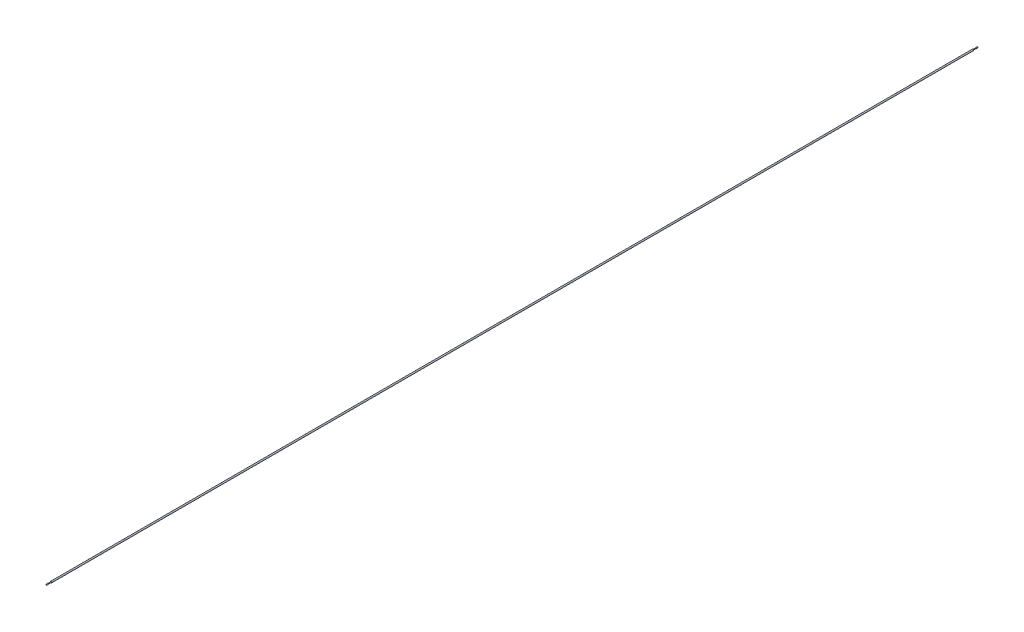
ISO-10303-21;
HEADER;
FILE_DESCRIPTION(('STEP AP214'),'2;1');
FILE_NAME('part.step','',(''),(''),'','','');
FILE_SCHEMA(('AUTOMOTIVE_DESIGN { 1 0 10303 214 1 1 1 1 }'));
ENDSEC;
DATA;
#1=APPLICATION_CONTEXT('core data for automotive mechanical design processes');
#2=APPLICATION_PROTOCOL_DEFINITION('international standard','automotive_design',2000,#1);
#3=PRODUCT_CONTEXT('',#1,'mechanical');
#4=PRODUCT('Part','Part','',(#3));
#5=PRODUCT_RELATED_PRODUCT_CATEGORY('part','',(#4));
#6=PRODUCT_DEFINITION_FORMATION('','',#4);
#7=PRODUCT_DEFINITION_CONTEXT('part definition',#1,'design');
#8=PRODUCT_DEFINITION('design','',#6,#7);
#9=PRODUCT_DEFINITION_SHAPE('','',#8);
#10=(LENGTH_UNIT() NAMED_UNIT(*) SI_UNIT(.MILLI.,.METRE.));
#11=(NAMED_UNIT(*) PLANE_ANGLE_UNIT() SI_UNIT($,.RADIAN.));
#12=(NAMED_UNIT(*) SI_UNIT($,.STERADIAN.) SOLID_ANGLE_UNIT());
#13=UNCERTAINTY_MEASURE_WITH_UNIT(LENGTH_MEASURE(1.E-05),#10,'distance_accuracy_value','');
#14=(GEOMETRIC_REPRESENTATION_CONTEXT(3) GLOBAL_UNCERTAINTY_ASSIGNED_CONTEXT((#13)) GLOBAL_UNIT_ASSIGNED_CONTEXT((#10,
#11,#12)) REPRESENTATION_CONTEXT('',''));
#15=CARTESIAN_POINT('',(0.,0.,0.));
#16=DIRECTION('',(0.,0.,1.));
#17=DIRECTION('',(1.,0.,0.));
#18=AXIS2_PLACEMENT_3D('',#15,#16,#17);
#19=CARTESIAN_POINT('',(0.,0.,2133.6));
#20=DIRECTION('',(0.,0.,-1.));
#21=DIRECTION('',(-1.,0.,0.));
#22=AXIS2_PLACEMENT_3D('',#19,#20,#21);
#23=CYLINDRICAL_SURFACE('',#22,3.175);
#24=CARTESIAN_POINT('',(0.,0.,2137.41));
#25=DIRECTION('',(0.,0.,1.));
#26=DIRECTION('',(1.,0.,0.));
#27=AXIS2_PLACEMENT_3D('',#24,#25,#26);
#28=CIRCLE('',#27,3.175);
#29=CARTESIAN_POINT('',(3.175,0.,2137.41));
#30=VERTEX_POINT('',#29);
#31=EDGE_CURVE('E72',#30,#30,#28,.T.);
#32=ORIENTED_EDGE('',*,*,#31,.F.);
#33=EDGE_LOOP('',(#32));
#34=FACE_BOUND('',#33,.T.);
#35=CARTESIAN_POINT('',(0.,0.,-2137.41));
#36=DIRECTION('',(0.,0.,1.));
#37=DIRECTION('',(1.,0.,0.));
#38=AXIS2_PLACEMENT_3D('',#35,#36,#37);
#39=CIRCLE('',#38,3.175);
#40=CARTESIAN_POINT('',(3.175,0.,-2137.41));
#41=VERTEX_POINT('',#40);
#42=EDGE_CURVE('E80',#41,#41,#39,.T.);
#43=ORIENTED_EDGE('',*,*,#42,.T.);
#44=EDGE_LOOP('',(#43));
#45=FACE_BOUND('',#44,.T.);
#46=ADVANCED_FACE('F32',(#34,#45),#23,.T.);
#47=CARTESIAN_POINT('',(0.,0.,2137.41));
#48=DIRECTION('',(0.,0.,1.));
#49=DIRECTION('',(1.,0.,0.));
#50=AXIS2_PLACEMENT_3D('',#47,#48,#49);
#51=PLANE('',#50);
#52=CARTESIAN_POINT('',(0.,0.,2137.41));
#53=DIRECTION('',(0.,0.,1.));
#54=DIRECTION('',(1.,0.,0.));
#55=AXIS2_PLACEMENT_3D('',#52,#53,#54);
#56=CIRCLE('',#55,1.5875);
#57=CARTESIAN_POINT('',(1.5875,0.,2137.41));
#58=VERTEX_POINT('',#57);
#59=EDGE_CURVE('E65',#58,#58,#56,.T.);
#60=ORIENTED_EDGE('',*,*,#59,.F.);
#61=EDGE_LOOP('',(#60));
#62=FACE_BOUND('',#61,.T.);
#63=ORIENTED_EDGE('',*,*,#31,.T.);
#64=EDGE_LOOP('',(#63));
#65=FACE_BOUND('',#64,.T.);
#66=ADVANCED_FACE('F107',(#62,#65),#51,.T.);
#67=CARTESIAN_POINT('',(0.,0.,2150.11));
#68=DIRECTION('',(0.,0.,-1.));
#69=DIRECTION('',(-1.,0.,0.));
#70=AXIS2_PLACEMENT_3D('',#67,#68,#69);
#71=CYLINDRICAL_SURFACE('',#70,1.5875);
#72=CARTESIAN_POINT('',(0.,0.,2150.11));
#73=DIRECTION('',(0.,0.,1.));
#74=DIRECTION('',(1.,0.,0.));
#75=AXIS2_PLACEMENT_3D('',#72,#73,#74);
#76=CIRCLE('',#75,1.5875);
#77=CARTESIAN_POINT('',(1.5875,0.,2150.11));
#78=VERTEX_POINT('',#77);
#79=EDGE_CURVE('E75',#78,#78,#76,.T.);
#80=ORIENTED_EDGE('',*,*,#79,.F.);
#81=EDGE_LOOP('',(#80));
#82=FACE_BOUND('',#81,.T.);
#83=ORIENTED_EDGE('',*,*,#59,.T.);
#84=EDGE_LOOP('',(#83));
#85=FACE_BOUND('',#84,.T.);
#86=ADVANCED_FACE('F113',(#82,#85),#71,.T.);
#87=CARTESIAN_POINT('',(0.,0.,2159.));
#88=DIRECTION('',(0.,0.,-1.));
#89=DIRECTION('',(-1.,0.,0.));
#90=AXIS2_PLACEMENT_3D('',#87,#88,#89);
#91=CYLINDRICAL_SURFACE('',#90,2.3495);
#92=CARTESIAN_POINT('',(0.,0.,2150.745));
#93=DIRECTION('',(0.,0.,1.));
#94=DIRECTION('',(1.,0.,0.));
#95=AXIS2_PLACEMENT_3D('',#92,#93,#94);
#96=CIRCLE('',#95,2.3495);
#97=CARTESIAN_POINT('',(2.3495,0.,2150.745));
#98=VERTEX_POINT('',#97);
#99=EDGE_CURVE('E59',#98,#98,#96,.T.);
#100=ORIENTED_EDGE('',*,*,#99,.T.);
#101=EDGE_LOOP('',(#100));
#102=FACE_BOUND('',#101,.T.);
#103=CARTESIAN_POINT('',(0.,0.,2158.365));
#104=DIRECTION('',(0.,0.,1.));
#105=DIRECTION('',(1.,0.,0.));
#106=AXIS2_PLACEMENT_3D('',#103,#104,#105);
#107=CIRCLE('',#106,2.3495);
#108=CARTESIAN_POINT('',(2.3495,0.,2158.365));
#109=VERTEX_POINT('',#108);
#110=EDGE_CURVE('E62',#109,#109,#107,.F.);
#111=ORIENTED_EDGE('',*,*,#110,.T.);
#112=EDGE_LOOP('',(#111));
#113=FACE_BOUND('',#112,.T.);
#114=ADVANCED_FACE('F142',(#102,#113),#91,.T.);
#115=CARTESIAN_POINT('',(0.,0.,2159.));
#116=DIRECTION('',(0.,0.,1.));
#117=DIRECTION('',(1.,0.,0.));
#118=AXIS2_PLACEMENT_3D('',#115,#116,#117);
#119=PLANE('',#118);
#120=CARTESIAN_POINT('',(0.,0.,2159.));
#121=DIRECTION('',(0.,0.,1.));
#122=DIRECTION('',(1.,0.,0.));
#123=AXIS2_PLACEMENT_3D('',#120,#121,#122);
#124=CIRCLE('',#123,1.71450000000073);
#125=CARTESIAN_POINT('',(1.71450000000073,0.,2159.));
#126=VERTEX_POINT('',#125);
#127=EDGE_CURVE('E53',#126,#126,#124,.T.);
#128=ORIENTED_EDGE('',*,*,#127,.T.);
#129=EDGE_LOOP('',(#128));
#130=FACE_BOUND('',#129,.T.);
#131=ADVANCED_FACE('F140',(#130),#119,.T.);
#132=CARTESIAN_POINT('',(0.,0.,2150.11));
#133=DIRECTION('',(0.,0.,1.));
#134=DIRECTION('',(1.,0.,0.));
#135=AXIS2_PLACEMENT_3D('',#132,#133,#134);
#136=PLANE('',#135);
#137=CARTESIAN_POINT('',(0.,0.,2150.11));
#138=DIRECTION('',(0.,0.,1.));
#139=DIRECTION('',(1.,0.,0.));
#140=AXIS2_PLACEMENT_3D('',#137,#138,#139);
#141=CIRCLE('',#140,1.71449999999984);
#142=CARTESIAN_POINT('',(1.71449999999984,0.,2150.11));
#143=VERTEX_POINT('',#142);
#144=EDGE_CURVE('E56',#143,#143,#141,.F.);
#145=ORIENTED_EDGE('',*,*,#144,.T.);
#146=EDGE_LOOP('',(#145));
#147=FACE_BOUND('',#146,.T.);
#148=ORIENTED_EDGE('',*,*,#79,.T.);
#149=EDGE_LOOP('',(#148));
#150=FACE_BOUND('',#149,.T.);
#151=ADVANCED_FACE('F126',(#147,#150),#136,.F.);
#152=CARTESIAN_POINT('',(0.,0.,2150.745));
#153=DIRECTION('',(0.,0.,1.));
#154=DIRECTION('',(1.,0.,0.));
#155=AXIS2_PLACEMENT_3D('',#152,#153,#154);
#156=CONICAL_SURFACE('',#155,2.3495,0.78539816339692);
#157=ORIENTED_EDGE('',*,*,#144,.F.);
#158=EDGE_LOOP('',(#157));
#159=FACE_BOUND('',#158,.T.);
#160=ORIENTED_EDGE('',*,*,#99,.F.);
#161=EDGE_LOOP('',(#160));
#162=FACE_BOUND('',#161,.T.);
#163=ADVANCED_FACE('F122',(#159,#162),#156,.T.);
#164=CARTESIAN_POINT('',(0.,0.,2159.));
#165=DIRECTION('',(0.,0.,-1.));
#166=DIRECTION('',(-1.,0.,0.));
#167=AXIS2_PLACEMENT_3D('',#164,#165,#166);
#168=CONICAL_SURFACE('',#167,1.71450000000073,0.78539816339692);
#169=ORIENTED_EDGE('',*,*,#110,.F.);
#170=EDGE_LOOP('',(#169));
#171=FACE_BOUND('',#170,.T.);
#172=ORIENTED_EDGE('',*,*,#127,.F.);
#173=EDGE_LOOP('',(#172));
#174=FACE_BOUND('',#173,.T.);
#175=ADVANCED_FACE('F125',(#171,#174),#168,.T.);
#176=CARTESIAN_POINT('',(0.,0.,-2137.41));
#177=DIRECTION('',(0.,0.,-1.));
#178=DIRECTION('',(1.,0.,0.));
#179=AXIS2_PLACEMENT_3D('',#176,#177,#178);
#180=PLANE('',#179);
#181=CARTESIAN_POINT('',(0.,0.,-2137.41));
#182=DIRECTION('',(0.,0.,1.));
#183=DIRECTION('',(1.,0.,0.));
#184=AXIS2_PLACEMENT_3D('',#181,#182,#183);
#185=CIRCLE('',#184,1.5875);
#186=CARTESIAN_POINT('',(1.5875,0.,-2137.41));
#187=VERTEX_POINT('',#186);
#188=EDGE_CURVE('E83',#187,#187,#185,.T.);
#189=ORIENTED_EDGE('',*,*,#188,.T.);
#190=EDGE_LOOP('',(#189));
#191=FACE_BOUND('',#190,.T.);
#192=ORIENTED_EDGE('',*,*,#42,.F.);
#193=EDGE_LOOP('',(#192));
#194=FACE_BOUND('',#193,.T.);
#195=ADVANCED_FACE('F129',(#191,#194),#180,.T.);
#196=CARTESIAN_POINT('',(0.,0.,-2150.11));
#197=DIRECTION('',(0.,0.,1.));
#198=DIRECTION('',(1.,0.,0.));
#199=AXIS2_PLACEMENT_3D('',#196,#197,#198);
#200=CYLINDRICAL_SURFACE('',#199,1.5875);
#201=CARTESIAN_POINT('',(0.,0.,-2150.11));
#202=DIRECTION('',(0.,0.,1.));
#203=DIRECTION('',(1.,0.,0.));
#204=AXIS2_PLACEMENT_3D('',#201,#202,#203);
#205=CIRCLE('',#204,1.5875);
#206=CARTESIAN_POINT('',(1.5875,0.,-2150.11));
#207=VERTEX_POINT('',#206);
#208=EDGE_CURVE('E86',#207,#207,#205,.T.);
#209=ORIENTED_EDGE('',*,*,#208,.T.);
#210=EDGE_LOOP('',(#209));
#211=FACE_BOUND('',#210,.T.);
#212=ORIENTED_EDGE('',*,*,#188,.F.);
#213=EDGE_LOOP('',(#212));
#214=FACE_BOUND('',#213,.T.);
#215=ADVANCED_FACE('F90',(#211,#214),#200,.T.);
#216=CARTESIAN_POINT('',(0.,0.,-2159.));
#217=DIRECTION('',(0.,0.,1.));
#218=DIRECTION('',(1.,0.,0.));
#219=AXIS2_PLACEMENT_3D('',#216,#217,#218);
#220=CYLINDRICAL_SURFACE('',#219,2.3495);
#221=CARTESIAN_POINT('',(0.,0.,-2158.365));
#222=DIRECTION('',(0.,0.,-1.));
#223=DIRECTION('',(-1.,0.,0.));
#224=AXIS2_PLACEMENT_3D('',#221,#222,#223);
#225=CIRCLE('',#224,2.3495);
#226=CARTESIAN_POINT('',(-2.3495,0.,-2158.365));
#227=VERTEX_POINT('',#226);
#228=EDGE_CURVE('E44',#227,#227,#225,.F.);
#229=ORIENTED_EDGE('',*,*,#228,.T.);
#230=EDGE_LOOP('',(#229));
#231=FACE_BOUND('',#230,.T.);
#232=CARTESIAN_POINT('',(0.,0.,-2150.745));
#233=DIRECTION('',(0.,0.,-1.));
#234=DIRECTION('',(-1.,0.,0.));
#235=AXIS2_PLACEMENT_3D('',#232,#233,#234);
#236=CIRCLE('',#235,2.3495);
#237=CARTESIAN_POINT('',(-2.3495,0.,-2150.745));
#238=VERTEX_POINT('',#237);
#239=EDGE_CURVE('E48',#238,#238,#236,.T.);
#240=ORIENTED_EDGE('',*,*,#239,.T.);
#241=EDGE_LOOP('',(#240));
#242=FACE_BOUND('',#241,.T.);
#243=ADVANCED_FACE('F103',(#231,#242),#220,.T.);
#244=CARTESIAN_POINT('',(0.,0.,-2159.));
#245=DIRECTION('',(0.,0.,-1.));
#246=DIRECTION('',(1.,0.,0.));
#247=AXIS2_PLACEMENT_3D('',#244,#245,#246);
#248=PLANE('',#247);
#249=CARTESIAN_POINT('',(0.,0.,-2159.));
#250=DIRECTION('',(0.,0.,-1.));
#251=DIRECTION('',(-1.,0.,0.));
#252=AXIS2_PLACEMENT_3D('',#249,#250,#251);
#253=CIRCLE('',#252,1.71449999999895);
#254=CARTESIAN_POINT('',(-1.71449999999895,0.,-2159.));
#255=VERTEX_POINT('',#254);
#256=EDGE_CURVE('E40',#255,#255,#253,.T.);
#257=ORIENTED_EDGE('',*,*,#256,.T.);
#258=EDGE_LOOP('',(#257));
#259=FACE_BOUND('',#258,.T.);
#260=ADVANCED_FACE('F96',(#259),#248,.T.);
#261=CARTESIAN_POINT('',(0.,0.,-2150.11));
#262=DIRECTION('',(0.,0.,-1.));
#263=DIRECTION('',(1.,0.,0.));
#264=AXIS2_PLACEMENT_3D('',#261,#262,#263);
#265=PLANE('',#264);
#266=CARTESIAN_POINT('',(0.,0.,-2150.11));
#267=DIRECTION('',(0.,0.,-1.));
#268=DIRECTION('',(-1.,0.,0.));
#269=AXIS2_PLACEMENT_3D('',#266,#267,#268);
#270=CIRCLE('',#269,1.71450000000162);
#271=CARTESIAN_POINT('',(-1.71450000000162,0.,-2150.11));
#272=VERTEX_POINT('',#271);
#273=EDGE_CURVE('E10',#272,#272,#270,.F.);
#274=ORIENTED_EDGE('',*,*,#273,.T.);
#275=EDGE_LOOP('',(#274));
#276=FACE_BOUND('',#275,.T.);
#277=ORIENTED_EDGE('',*,*,#208,.F.);
#278=EDGE_LOOP('',(#277));
#279=FACE_BOUND('',#278,.T.);
#280=ADVANCED_FACE('F93',(#276,#279),#265,.F.);
#281=CARTESIAN_POINT('',(0.,0.,-2158.365));
#282=DIRECTION('',(0.,0.,1.));
#283=DIRECTION('',(1.,0.,0.));
#284=AXIS2_PLACEMENT_3D('',#281,#282,#283);
#285=CONICAL_SURFACE('',#284,2.3495,0.78539816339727);
#286=ORIENTED_EDGE('',*,*,#256,.F.);
#287=EDGE_LOOP('',(#286));
#288=FACE_BOUND('',#287,.T.);
#289=ORIENTED_EDGE('',*,*,#228,.F.);
#290=EDGE_LOOP('',(#289));
#291=FACE_BOUND('',#290,.T.);
#292=ADVANCED_FACE('F95',(#288,#291),#285,.T.);
#293=CARTESIAN_POINT('',(0.,0.,-2150.11));
#294=DIRECTION('',(0.,0.,-1.));
#295=DIRECTION('',(-1.,0.,0.));
#296=AXIS2_PLACEMENT_3D('',#293,#294,#295);
#297=CONICAL_SURFACE('',#296,1.71450000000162,0.78539816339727);
#298=ORIENTED_EDGE('',*,*,#239,.F.);
#299=EDGE_LOOP('',(#298));
#300=FACE_BOUND('',#299,.T.);
#301=ORIENTED_EDGE('',*,*,#273,.F.);
#302=EDGE_LOOP('',(#301));
#303=FACE_BOUND('',#302,.T.);
#304=ADVANCED_FACE('F34',(#300,#303),#297,.T.);
#305=CLOSED_SHELL('',(#46,#66,#86,#114,#131,#151,#163,#175,#195,#215,#243,#260,#280,#292,#304));
#306=CARTESIAN_POINT('',(0.,0.,-2133.6));
#307=DIRECTION('',(0.,0.,-1.));
#308=DIRECTION('',(1.,0.,0.));
#309=AXIS2_PLACEMENT_3D('',#306,#307,#308);
#310=PLANE('',#309);
#311=CARTESIAN_POINT('',(0.,0.,-2133.6));
#312=DIRECTION('',(0.,0.,1.));
#313=DIRECTION('',(1.,0.,0.));
#314=AXIS2_PLACEMENT_3D('',#311,#312,#313);
#315=CIRCLE('',#314,2.413);
#316=CARTESIAN_POINT('',(2.413,0.,-2133.6));
#317=VERTEX_POINT('',#316);
#318=EDGE_CURVE('E66',#317,#317,#315,.T.);
#319=ORIENTED_EDGE('',*,*,#318,.T.);
#320=EDGE_LOOP('',(#319));
#321=FACE_BOUND('',#320,.T.);
#322=ADVANCED_FACE('F153',(#321),#310,.F.);
#323=CARTESIAN_POINT('',(0.,0.,2133.6));
#324=DIRECTION('',(0.,0.,1.));
#325=DIRECTION('',(1.,0.,0.));
#326=AXIS2_PLACEMENT_3D('',#323,#324,#325);
#327=PLANE('',#326);
#328=CARTESIAN_POINT('',(0.,0.,2133.6));
#329=DIRECTION('',(0.,0.,1.));
#330=DIRECTION('',(1.,0.,0.));
#331=AXIS2_PLACEMENT_3D('',#328,#329,#330);
#332=CIRCLE('',#331,2.413);
#333=CARTESIAN_POINT('',(2.413,0.,2133.6));
#334=VERTEX_POINT('',#333);
#335=EDGE_CURVE('E69',#334,#334,#332,.T.);
#336=ORIENTED_EDGE('',*,*,#335,.F.);
#337=EDGE_LOOP('',(#336));
#338=FACE_BOUND('',#337,.T.);
#339=ADVANCED_FACE('F157',(#338),#327,.F.);
#340=CARTESIAN_POINT('',(0.,0.,2133.6));
#341=DIRECTION('',(0.,0.,-1.));
#342=DIRECTION('',(-1.,0.,0.));
#343=AXIS2_PLACEMENT_3D('',#340,#341,#342);
#344=CYLINDRICAL_SURFACE('',#343,2.413);
#345=ORIENTED_EDGE('',*,*,#335,.T.);
#346=EDGE_LOOP('',(#345));
#347=FACE_BOUND('',#346,.T.);
#348=ORIENTED_EDGE('',*,*,#318,.F.);
#349=EDGE_LOOP('',(#348));
#350=FACE_BOUND('',#349,.T.);
#351=ADVANCED_FACE('F120',(#347,#350),#344,.F.);
#352=CLOSED_SHELL('',(#322,#339,#351));
#353=ORIENTED_CLOSED_SHELL('',*,#352,.T.);
#354=BREP_WITH_VOIDS('B2',#305,(#353));
#355=ADVANCED_BREP_SHAPE_REPRESENTATION('',(#18,#354),#14);
#356=SHAPE_DEFINITION_REPRESENTATION(#9,#355);
ENDSEC;
END-ISO-10303-21;
